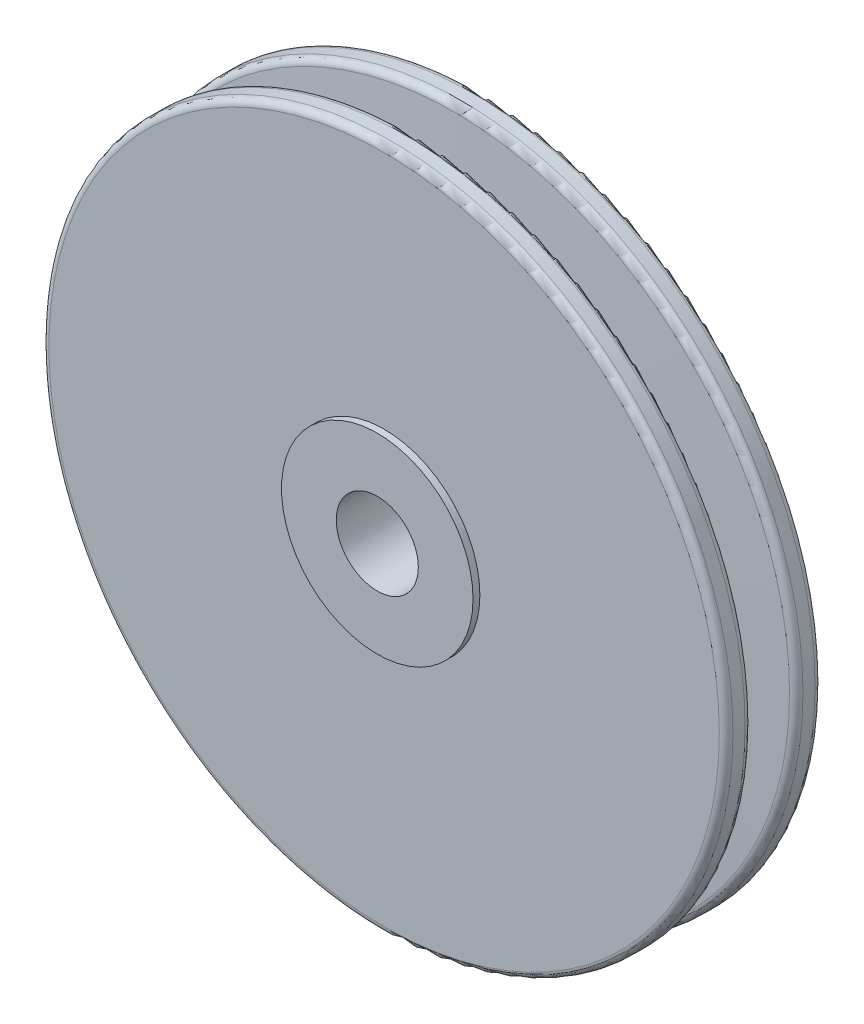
ISO-10303-21;
HEADER;
FILE_DESCRIPTION(('STEP AP214'),'2;1');
FILE_NAME('part.step','',(''),(''),'','','');
FILE_SCHEMA(('AUTOMOTIVE_DESIGN { 1 0 10303 214 1 1 1 1 }'));
ENDSEC;
DATA;
#1=APPLICATION_CONTEXT('core data for automotive mechanical design processes');
#2=APPLICATION_PROTOCOL_DEFINITION('international standard','automotive_design',2000,#1);
#3=PRODUCT_CONTEXT('',#1,'mechanical');
#4=PRODUCT('Part','Part','',(#3));
#5=PRODUCT_RELATED_PRODUCT_CATEGORY('part','',(#4));
#6=PRODUCT_DEFINITION_FORMATION('','',#4);
#7=PRODUCT_DEFINITION_CONTEXT('part definition',#1,'design');
#8=PRODUCT_DEFINITION('design','',#6,#7);
#9=PRODUCT_DEFINITION_SHAPE('','',#8);
#10=(LENGTH_UNIT() NAMED_UNIT(*) SI_UNIT(.MILLI.,.METRE.));
#11=(NAMED_UNIT(*) PLANE_ANGLE_UNIT() SI_UNIT($,.RADIAN.));
#12=(NAMED_UNIT(*) SI_UNIT($,.STERADIAN.) SOLID_ANGLE_UNIT());
#13=UNCERTAINTY_MEASURE_WITH_UNIT(LENGTH_MEASURE(1.E-05),#10,'distance_accuracy_value','');
#14=(GEOMETRIC_REPRESENTATION_CONTEXT(3) GLOBAL_UNCERTAINTY_ASSIGNED_CONTEXT((#13)) GLOBAL_UNIT_ASSIGNED_CONTEXT((#10,
#11,#12)) REPRESENTATION_CONTEXT('',''));
#15=CARTESIAN_POINT('',(0.,0.,0.));
#16=DIRECTION('',(0.,0.,1.));
#17=DIRECTION('',(1.,0.,0.));
#18=AXIS2_PLACEMENT_3D('',#15,#16,#17);
#19=CARTESIAN_POINT('',(0.,0.,3.));
#20=DIRECTION('',(0.,0.,1.));
#21=DIRECTION('',(1.,0.,0.));
#22=AXIS2_PLACEMENT_3D('',#19,#20,#21);
#23=TOROIDAL_SURFACE('',#22,24.5,0.5);
#24=CARTESIAN_POINT('',(0.,0.,3.5));
#25=DIRECTION('',(0.,0.,1.));
#26=DIRECTION('',(1.,0.,0.));
#27=AXIS2_PLACEMENT_3D('',#24,#25,#26);
#28=CIRCLE('',#27,24.5);
#29=CARTESIAN_POINT('',(24.5,0.,3.5));
#30=VERTEX_POINT('',#29);
#31=EDGE_CURVE('E10',#30,#30,#28,.T.);
#32=ORIENTED_EDGE('',*,*,#31,.F.);
#33=EDGE_LOOP('',(#32));
#34=FACE_BOUND('',#33,.T.);
#35=CARTESIAN_POINT('',(0.,0.,3.));
#36=DIRECTION('',(0.,0.,1.));
#37=DIRECTION('',(1.,0.,0.));
#38=AXIS2_PLACEMENT_3D('',#35,#36,#37);
#39=CIRCLE('',#38,25.);
#40=CARTESIAN_POINT('',(25.,0.,3.));
#41=VERTEX_POINT('',#40);
#42=EDGE_CURVE('E81',#41,#41,#39,.T.);
#43=ORIENTED_EDGE('',*,*,#42,.T.);
#44=EDGE_LOOP('',(#43));
#45=FACE_BOUND('',#44,.T.);
#46=ADVANCED_FACE('F29',(#34,#45),#23,.T.);
#47=CARTESIAN_POINT('',(0.,7.,3.5));
#48=DIRECTION('',(0.,0.,-1.));
#49=DIRECTION('',(-1.,0.,0.));
#50=AXIS2_PLACEMENT_3D('',#47,#48,#49);
#51=PLANE('',#50);
#52=CARTESIAN_POINT('',(0.,0.,3.5));
#53=DIRECTION('',(0.,0.,1.));
#54=DIRECTION('',(1.,0.,0.));
#55=AXIS2_PLACEMENT_3D('',#52,#53,#54);
#56=CIRCLE('',#55,7.);
#57=CARTESIAN_POINT('',(7.,0.,3.5));
#58=VERTEX_POINT('',#57);
#59=EDGE_CURVE('E35',#58,#58,#56,.T.);
#60=ORIENTED_EDGE('',*,*,#59,.F.);
#61=EDGE_LOOP('',(#60));
#62=FACE_BOUND('',#61,.T.);
#63=ORIENTED_EDGE('',*,*,#31,.T.);
#64=EDGE_LOOP('',(#63));
#65=FACE_BOUND('',#64,.T.);
#66=ADVANCED_FACE('F166',(#62,#65),#51,.F.);
#67=CARTESIAN_POINT('',(0.,0.,0.));
#68=DIRECTION('',(0.,0.,1.));
#69=DIRECTION('',(1.,0.,0.));
#70=AXIS2_PLACEMENT_3D('',#67,#68,#69);
#71=CYLINDRICAL_SURFACE('',#70,7.);
#72=CARTESIAN_POINT('',(0.,0.,4.));
#73=DIRECTION('',(0.,0.,1.));
#74=DIRECTION('',(1.,0.,0.));
#75=AXIS2_PLACEMENT_3D('',#72,#73,#74);
#76=CIRCLE('',#75,7.);
#77=CARTESIAN_POINT('',(7.,0.,4.));
#78=VERTEX_POINT('',#77);
#79=EDGE_CURVE('E39',#78,#78,#76,.T.);
#80=ORIENTED_EDGE('',*,*,#79,.F.);
#81=EDGE_LOOP('',(#80));
#82=FACE_BOUND('',#81,.T.);
#83=ORIENTED_EDGE('',*,*,#59,.T.);
#84=EDGE_LOOP('',(#83));
#85=FACE_BOUND('',#84,.T.);
#86=ADVANCED_FACE('F161',(#82,#85),#71,.T.);
#87=CARTESIAN_POINT('',(0.,7.,4.));
#88=DIRECTION('',(0.,0.,-1.));
#89=DIRECTION('',(-1.,0.,0.));
#90=AXIS2_PLACEMENT_3D('',#87,#88,#89);
#91=PLANE('',#90);
#92=CARTESIAN_POINT('',(0.,0.,4.));
#93=DIRECTION('',(0.,0.,1.));
#94=DIRECTION('',(1.,0.,0.));
#95=AXIS2_PLACEMENT_3D('',#92,#93,#94);
#96=CIRCLE('',#95,3.);
#97=CARTESIAN_POINT('',(3.,0.,4.));
#98=VERTEX_POINT('',#97);
#99=EDGE_CURVE('E43',#98,#98,#96,.T.);
#100=ORIENTED_EDGE('',*,*,#99,.F.);
#101=EDGE_LOOP('',(#100));
#102=FACE_BOUND('',#101,.T.);
#103=ORIENTED_EDGE('',*,*,#79,.T.);
#104=EDGE_LOOP('',(#103));
#105=FACE_BOUND('',#104,.T.);
#106=ADVANCED_FACE('F155',(#102,#105),#91,.F.);
#107=CARTESIAN_POINT('',(0.,0.,0.));
#108=DIRECTION('',(0.,0.,1.));
#109=DIRECTION('',(1.,0.,0.));
#110=AXIS2_PLACEMENT_3D('',#107,#108,#109);
#111=CYLINDRICAL_SURFACE('',#110,3.);
#112=CARTESIAN_POINT('',(0.,0.,-4.));
#113=DIRECTION('',(0.,0.,1.));
#114=DIRECTION('',(1.,0.,0.));
#115=AXIS2_PLACEMENT_3D('',#112,#113,#114);
#116=CIRCLE('',#115,3.);
#117=CARTESIAN_POINT('',(3.,0.,-4.));
#118=VERTEX_POINT('',#117);
#119=EDGE_CURVE('E48',#118,#118,#116,.T.);
#120=ORIENTED_EDGE('',*,*,#119,.F.);
#121=EDGE_LOOP('',(#120));
#122=FACE_BOUND('',#121,.T.);
#123=ORIENTED_EDGE('',*,*,#99,.T.);
#124=EDGE_LOOP('',(#123));
#125=FACE_BOUND('',#124,.T.);
#126=ADVANCED_FACE('F149',(#122,#125),#111,.F.);
#127=CARTESIAN_POINT('',(0.,7.,-4.));
#128=DIRECTION('',(0.,0.,1.));
#129=DIRECTION('',(1.,0.,0.));
#130=AXIS2_PLACEMENT_3D('',#127,#128,#129);
#131=PLANE('',#130);
#132=CARTESIAN_POINT('',(0.,0.,-4.));
#133=DIRECTION('',(0.,0.,1.));
#134=DIRECTION('',(1.,0.,0.));
#135=AXIS2_PLACEMENT_3D('',#132,#133,#134);
#136=CIRCLE('',#135,7.);
#137=CARTESIAN_POINT('',(7.,0.,-4.));
#138=VERTEX_POINT('',#137);
#139=EDGE_CURVE('E51',#138,#138,#136,.T.);
#140=ORIENTED_EDGE('',*,*,#139,.F.);
#141=EDGE_LOOP('',(#140));
#142=FACE_BOUND('',#141,.T.);
#143=ORIENTED_EDGE('',*,*,#119,.T.);
#144=EDGE_LOOP('',(#143));
#145=FACE_BOUND('',#144,.T.);
#146=ADVANCED_FACE('F143',(#142,#145),#131,.F.);
#147=CARTESIAN_POINT('',(0.,0.,0.));
#148=DIRECTION('',(0.,0.,1.));
#149=DIRECTION('',(1.,0.,0.));
#150=AXIS2_PLACEMENT_3D('',#147,#148,#149);
#151=CYLINDRICAL_SURFACE('',#150,7.);
#152=CARTESIAN_POINT('',(0.,0.,-3.5));
#153=DIRECTION('',(0.,0.,1.));
#154=DIRECTION('',(1.,0.,0.));
#155=AXIS2_PLACEMENT_3D('',#152,#153,#154);
#156=CIRCLE('',#155,7.);
#157=CARTESIAN_POINT('',(7.,0.,-3.5));
#158=VERTEX_POINT('',#157);
#159=EDGE_CURVE('E54',#158,#158,#156,.T.);
#160=ORIENTED_EDGE('',*,*,#159,.F.);
#161=EDGE_LOOP('',(#160));
#162=FACE_BOUND('',#161,.T.);
#163=ORIENTED_EDGE('',*,*,#139,.T.);
#164=EDGE_LOOP('',(#163));
#165=FACE_BOUND('',#164,.T.);
#166=ADVANCED_FACE('F137',(#162,#165),#151,.T.);
#167=CARTESIAN_POINT('',(0.,7.,-3.5));
#168=DIRECTION('',(0.,0.,1.));
#169=DIRECTION('',(1.,0.,0.));
#170=AXIS2_PLACEMENT_3D('',#167,#168,#169);
#171=PLANE('',#170);
#172=CARTESIAN_POINT('',(0.,0.,-3.5));
#173=DIRECTION('',(0.,0.,1.));
#174=DIRECTION('',(1.,0.,0.));
#175=AXIS2_PLACEMENT_3D('',#172,#173,#174);
#176=CIRCLE('',#175,24.5);
#177=CARTESIAN_POINT('',(24.5,0.,-3.5));
#178=VERTEX_POINT('',#177);
#179=EDGE_CURVE('E57',#178,#178,#176,.T.);
#180=ORIENTED_EDGE('',*,*,#179,.F.);
#181=EDGE_LOOP('',(#180));
#182=FACE_BOUND('',#181,.T.);
#183=ORIENTED_EDGE('',*,*,#159,.T.);
#184=EDGE_LOOP('',(#183));
#185=FACE_BOUND('',#184,.T.);
#186=ADVANCED_FACE('F131',(#182,#185),#171,.F.);
#187=CARTESIAN_POINT('',(0.,0.,-3.));
#188=DIRECTION('',(0.,0.,1.));
#189=DIRECTION('',(1.,0.,0.));
#190=AXIS2_PLACEMENT_3D('',#187,#188,#189);
#191=TOROIDAL_SURFACE('',#190,24.5,0.5);
#192=CARTESIAN_POINT('',(0.,0.,-3.));
#193=DIRECTION('',(0.,0.,1.));
#194=DIRECTION('',(1.,0.,0.));
#195=AXIS2_PLACEMENT_3D('',#192,#193,#194);
#196=CIRCLE('',#195,25.);
#197=CARTESIAN_POINT('',(25.,0.,-3.));
#198=VERTEX_POINT('',#197);
#199=EDGE_CURVE('E60',#198,#198,#196,.T.);
#200=ORIENTED_EDGE('',*,*,#199,.F.);
#201=EDGE_LOOP('',(#200));
#202=FACE_BOUND('',#201,.T.);
#203=ORIENTED_EDGE('',*,*,#179,.T.);
#204=EDGE_LOOP('',(#203));
#205=FACE_BOUND('',#204,.T.);
#206=ADVANCED_FACE('F125',(#202,#205),#191,.T.);
#207=CARTESIAN_POINT('',(0.,0.,0.));
#208=DIRECTION('',(0.,0.,1.));
#209=DIRECTION('',(1.,0.,0.));
#210=AXIS2_PLACEMENT_3D('',#207,#208,#209);
#211=CYLINDRICAL_SURFACE('',#210,25.);
#212=CARTESIAN_POINT('',(0.,0.,-2.11773478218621));
#213=DIRECTION('',(0.,0.,1.));
#214=DIRECTION('',(1.,0.,0.));
#215=AXIS2_PLACEMENT_3D('',#212,#213,#214);
#216=CIRCLE('',#215,25.);
#217=CARTESIAN_POINT('',(25.,0.,-2.11773478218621));
#218=VERTEX_POINT('',#217);
#219=EDGE_CURVE('E63',#218,#218,#216,.T.);
#220=ORIENTED_EDGE('',*,*,#219,.F.);
#221=EDGE_LOOP('',(#220));
#222=FACE_BOUND('',#221,.T.);
#223=ORIENTED_EDGE('',*,*,#199,.T.);
#224=EDGE_LOOP('',(#223));
#225=FACE_BOUND('',#224,.T.);
#226=ADVANCED_FACE('F119',(#222,#225),#211,.T.);
#227=CARTESIAN_POINT('',(0.,0.,-2.11773478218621));
#228=DIRECTION('',(0.,0.,1.));
#229=DIRECTION('',(1.,0.,0.));
#230=AXIS2_PLACEMENT_3D('',#227,#228,#229);
#231=TOROIDAL_SURFACE('',#230,24.5,0.5);
#232=CARTESIAN_POINT('',(0.,0.,-1.61803936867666));
#233=DIRECTION('',(0.,0.,1.));
#234=DIRECTION('',(1.,0.,0.));
#235=AXIS2_PLACEMENT_3D('',#232,#233,#234);
#236=CIRCLE('',#235,24.5174497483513);
#237=CARTESIAN_POINT('',(24.5174497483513,0.,-1.61803936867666));
#238=VERTEX_POINT('',#237);
#239=EDGE_CURVE('E66',#238,#238,#236,.T.);
#240=ORIENTED_EDGE('',*,*,#239,.F.);
#241=EDGE_LOOP('',(#240));
#242=FACE_BOUND('',#241,.T.);
#243=ORIENTED_EDGE('',*,*,#219,.T.);
#244=EDGE_LOOP('',(#243));
#245=FACE_BOUND('',#244,.T.);
#246=ADVANCED_FACE('F113',(#242,#245),#231,.T.);
#247=CARTESIAN_POINT('',(0.,0.,-1.61803936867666));
#248=DIRECTION('',(0.,0.,-1.));
#249=DIRECTION('',(-1.,0.,0.));
#250=AXIS2_PLACEMENT_3D('',#247,#248,#249);
#251=CONICAL_SURFACE('',#250,24.5174497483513,1.53588974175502);
#252=CARTESIAN_POINT('',(0.,0.,-1.24923853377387));
#253=DIRECTION('',(0.,0.,1.));
#254=DIRECTION('',(1.,0.,0.));
#255=AXIS2_PLACEMENT_3D('',#252,#253,#254);
#256=CIRCLE('',#255,13.9563756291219);
#257=CARTESIAN_POINT('',(13.9563756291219,0.,-1.24923853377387));
#258=VERTEX_POINT('',#257);
#259=EDGE_CURVE('E69',#258,#258,#256,.T.);
#260=ORIENTED_EDGE('',*,*,#259,.F.);
#261=EDGE_LOOP('',(#260));
#262=FACE_BOUND('',#261,.T.);
#263=ORIENTED_EDGE('',*,*,#239,.T.);
#264=EDGE_LOOP('',(#263));
#265=FACE_BOUND('',#264,.T.);
#266=ADVANCED_FACE('F107',(#262,#265),#251,.T.);
#267=CARTESIAN_POINT('',(0.,0.,0.));
#268=DIRECTION('',(0.,0.,1.));
#269=DIRECTION('',(1.,0.,0.));
#270=AXIS2_PLACEMENT_3D('',#267,#268,#269);
#271=TOROIDAL_SURFACE('',#270,14.,1.25);
#272=CARTESIAN_POINT('',(0.,0.,1.24923853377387));
#273=DIRECTION('',(0.,0.,1.));
#274=DIRECTION('',(1.,0.,0.));
#275=AXIS2_PLACEMENT_3D('',#272,#273,#274);
#276=CIRCLE('',#275,13.9563756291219);
#277=CARTESIAN_POINT('',(13.9563756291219,0.,1.24923853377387));
#278=VERTEX_POINT('',#277);
#279=EDGE_CURVE('E72',#278,#278,#276,.T.);
#280=ORIENTED_EDGE('',*,*,#279,.F.);
#281=EDGE_LOOP('',(#280));
#282=FACE_BOUND('',#281,.T.);
#283=ORIENTED_EDGE('',*,*,#259,.T.);
#284=EDGE_LOOP('',(#283));
#285=FACE_BOUND('',#284,.T.);
#286=ADVANCED_FACE('F101',(#282,#285),#271,.F.);
#287=CARTESIAN_POINT('',(0.,0.,1.24923853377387));
#288=DIRECTION('',(0.,0.,1.));
#289=DIRECTION('',(1.,0.,0.));
#290=AXIS2_PLACEMENT_3D('',#287,#288,#289);
#291=CONICAL_SURFACE('',#290,13.9563756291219,1.53588974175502);
#292=CARTESIAN_POINT('',(0.,0.,1.61803936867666));
#293=DIRECTION('',(0.,0.,1.));
#294=DIRECTION('',(1.,0.,0.));
#295=AXIS2_PLACEMENT_3D('',#292,#293,#294);
#296=CIRCLE('',#295,24.5174497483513);
#297=CARTESIAN_POINT('',(24.5174497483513,0.,1.61803936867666));
#298=VERTEX_POINT('',#297);
#299=EDGE_CURVE('E75',#298,#298,#296,.T.);
#300=ORIENTED_EDGE('',*,*,#299,.F.);
#301=EDGE_LOOP('',(#300));
#302=FACE_BOUND('',#301,.T.);
#303=ORIENTED_EDGE('',*,*,#279,.T.);
#304=EDGE_LOOP('',(#303));
#305=FACE_BOUND('',#304,.T.);
#306=ADVANCED_FACE('F95',(#302,#305),#291,.T.);
#307=CARTESIAN_POINT('',(0.,0.,2.11773478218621));
#308=DIRECTION('',(0.,0.,1.));
#309=DIRECTION('',(1.,0.,0.));
#310=AXIS2_PLACEMENT_3D('',#307,#308,#309);
#311=TOROIDAL_SURFACE('',#310,24.5,0.5);
#312=CARTESIAN_POINT('',(0.,0.,2.11773478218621));
#313=DIRECTION('',(0.,0.,1.));
#314=DIRECTION('',(1.,0.,0.));
#315=AXIS2_PLACEMENT_3D('',#312,#313,#314);
#316=CIRCLE('',#315,25.);
#317=CARTESIAN_POINT('',(25.,0.,2.11773478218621));
#318=VERTEX_POINT('',#317);
#319=EDGE_CURVE('E78',#318,#318,#316,.T.);
#320=ORIENTED_EDGE('',*,*,#319,.F.);
#321=EDGE_LOOP('',(#320));
#322=FACE_BOUND('',#321,.T.);
#323=ORIENTED_EDGE('',*,*,#299,.T.);
#324=EDGE_LOOP('',(#323));
#325=FACE_BOUND('',#324,.T.);
#326=ADVANCED_FACE('F89',(#322,#325),#311,.T.);
#327=CARTESIAN_POINT('',(0.,0.,0.));
#328=DIRECTION('',(0.,0.,1.));
#329=DIRECTION('',(1.,0.,0.));
#330=AXIS2_PLACEMENT_3D('',#327,#328,#329);
#331=CYLINDRICAL_SURFACE('',#330,25.);
#332=ORIENTED_EDGE('',*,*,#42,.F.);
#333=EDGE_LOOP('',(#332));
#334=FACE_BOUND('',#333,.T.);
#335=ORIENTED_EDGE('',*,*,#319,.T.);
#336=EDGE_LOOP('',(#335));
#337=FACE_BOUND('',#336,.T.);
#338=ADVANCED_FACE('F86',(#334,#337),#331,.T.);
#339=CLOSED_SHELL('',(#46,#66,#86,#106,#126,#146,#166,#186,#206,#226,#246,#266,#286,#306,#326,#338));
#340=MANIFOLD_SOLID_BREP('B2',#339);
#341=ADVANCED_BREP_SHAPE_REPRESENTATION('',(#18,#340),#14);
#342=SHAPE_DEFINITION_REPRESENTATION(#9,#341);
ENDSEC;
END-ISO-10303-21;
